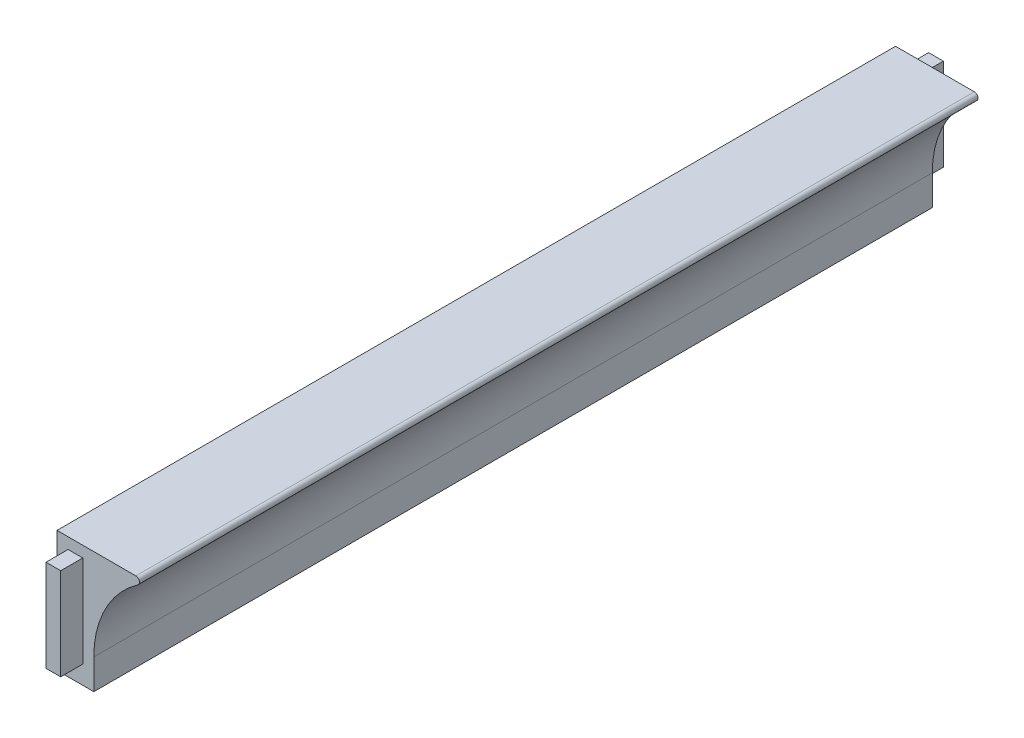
from build123d import *

# Parameters (mm, degrees)
BOSS_EXTRUDE1_DEPTH = 114
SKETCH2_W           = 4
SKETCH2_H           = 25
BOSS_EXTRUDE2_DEPTH = 6
FILLET1_R           = 1


with BuildPart() as part:
    # Sketch1 → Boss-Extrude1 (new, symmetric)
    with BuildSketch(Plane.XY):
        with BuildLine():
            Line((0, 0), (-25, 0))
            Line((-25, 0), (-25, -33))
            Line((-25, -33), (-15, -33))
            Line((-15, -33), (-15, -24.799193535))
            ThreePointArc((-15, -24.799193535), (-10.958297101, -10.307816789), (0, 0))
        make_face()
    extrude(amount=BOSS_EXTRUDE1_DEPTH, both=True)

    # Sketch2 → Boss-Extrude2 (add)
    with BuildSketch(Plane.XY.offset(114)):
        with Locations((-20, -15.5)):
            Rectangle(SKETCH2_W, SKETCH2_H)
    boss_extrude2 = extrude(amount=BOSS_EXTRUDE2_DEPTH)

    # Mirror1: Boss-Extrude2 across plane
    add(boss_extrude2.mirror(Plane.XY))

    # Fillet1
    fillet1_edges = [part.edges().sort_by_distance(p)[0] for p in [
        (0, 0, 0),
    ]]
    fillet(fillet1_edges, radius=FILLET1_R)


solid = part.part
